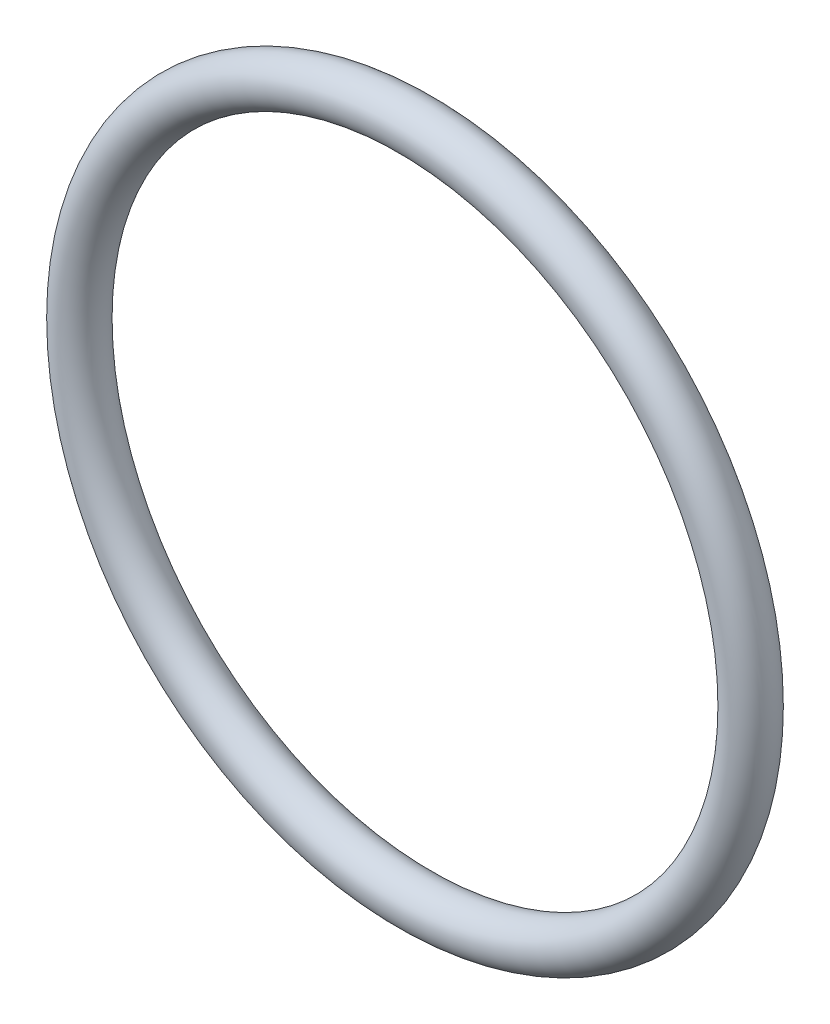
from build123d import *

# Parameters (mm, degrees)
SKIZZE1_R = 1


with BuildPart() as part:
    # Skizze1 → Rotation1 (revolve)
    with BuildSketch(Plane(origin=(0, 0, 0), x_dir=(0, 0, -1), z_dir=(1, 0, 0)), mode=Mode.PRIVATE) as rotation1_sk:
        with Locations((0, 14.5)):
            Circle(SKIZZE1_R)
    revolve(rotation1_sk.sketch.rotate(Axis((0, 0, 0), (0, 0, -1)), 90), axis=Axis((0, 0, 0), (0, 0, -1)))


solid = part.part
